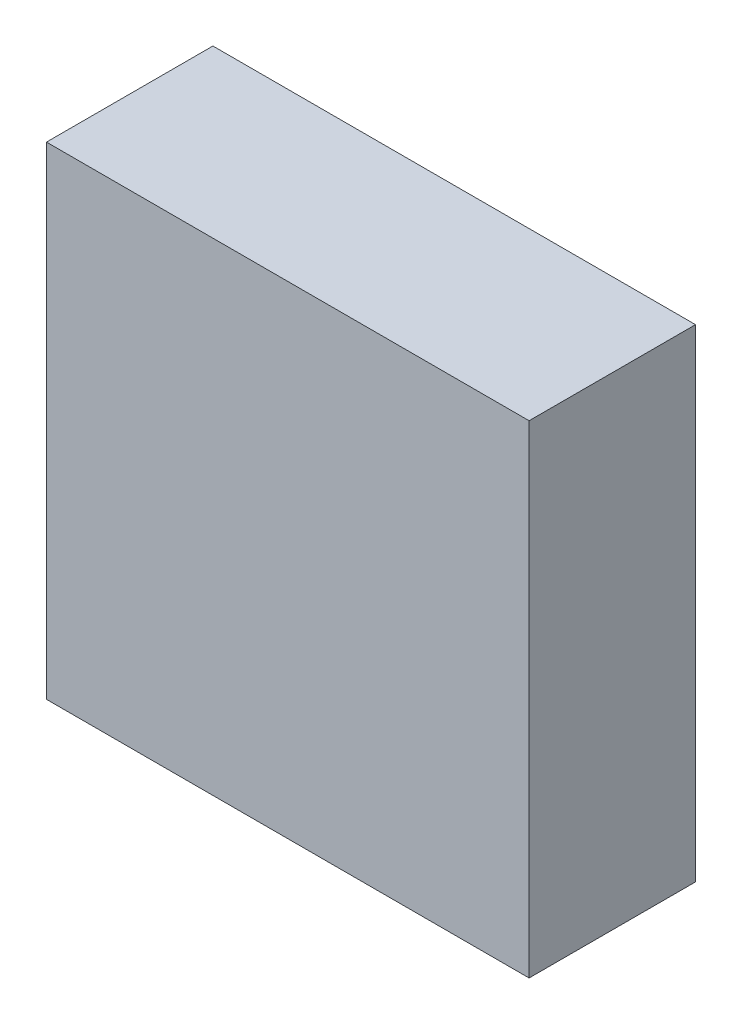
ISO-10303-21;
HEADER;
FILE_DESCRIPTION(('STEP AP214'),'2;1');
FILE_NAME('part.step','',(''),(''),'','','');
FILE_SCHEMA(('AUTOMOTIVE_DESIGN { 1 0 10303 214 1 1 1 1 }'));
ENDSEC;
DATA;
#1=APPLICATION_CONTEXT('core data for automotive mechanical design processes');
#2=APPLICATION_PROTOCOL_DEFINITION('international standard','automotive_design',2000,#1);
#3=PRODUCT_CONTEXT('',#1,'mechanical');
#4=PRODUCT('Part','Part','',(#3));
#5=PRODUCT_RELATED_PRODUCT_CATEGORY('part','',(#4));
#6=PRODUCT_DEFINITION_FORMATION('','',#4);
#7=PRODUCT_DEFINITION_CONTEXT('part definition',#1,'design');
#8=PRODUCT_DEFINITION('design','',#6,#7);
#9=PRODUCT_DEFINITION_SHAPE('','',#8);
#10=(LENGTH_UNIT() NAMED_UNIT(*) SI_UNIT(.MILLI.,.METRE.));
#11=(NAMED_UNIT(*) PLANE_ANGLE_UNIT() SI_UNIT($,.RADIAN.));
#12=(NAMED_UNIT(*) SI_UNIT($,.STERADIAN.) SOLID_ANGLE_UNIT());
#13=UNCERTAINTY_MEASURE_WITH_UNIT(LENGTH_MEASURE(1.E-05),#10,'distance_accuracy_value','');
#14=(GEOMETRIC_REPRESENTATION_CONTEXT(3) GLOBAL_UNCERTAINTY_ASSIGNED_CONTEXT((#13)) GLOBAL_UNIT_ASSIGNED_CONTEXT((#10,
#11,#12)) REPRESENTATION_CONTEXT('',''));
#15=CARTESIAN_POINT('',(0.,0.,0.));
#16=DIRECTION('',(0.,0.,1.));
#17=DIRECTION('',(1.,0.,0.));
#18=AXIS2_PLACEMENT_3D('',#15,#16,#17);
#19=CARTESIAN_POINT('',(-14.5,14.5,10.));
#20=DIRECTION('',(1.,0.,0.));
#21=DIRECTION('',(0.,1.,0.));
#22=AXIS2_PLACEMENT_3D('',#19,#20,#21);
#23=PLANE('',#22);
#24=DIRECTION('',(0.,-1.,0.));
#25=VECTOR('',#24,1.);
#26=CARTESIAN_POINT('',(-14.5,14.5,0.));
#27=LINE('',#26,#25);
#28=CARTESIAN_POINT('',(-14.5,14.5,0.));
#29=VERTEX_POINT('',#28);
#30=CARTESIAN_POINT('',(-14.5,-14.5,0.));
#31=VERTEX_POINT('',#30);
#32=EDGE_CURVE('E76',#29,#31,#27,.T.);
#33=ORIENTED_EDGE('',*,*,#32,.T.);
#34=DIRECTION('',(0.,0.,-1.));
#35=VECTOR('',#34,1.);
#36=CARTESIAN_POINT('',(-14.5,-14.5,10.));
#37=LINE('',#36,#35);
#38=CARTESIAN_POINT('',(-14.5,-14.5,10.));
#39=VERTEX_POINT('',#38);
#40=EDGE_CURVE('E11',#39,#31,#37,.T.);
#41=ORIENTED_EDGE('',*,*,#40,.F.);
#42=DIRECTION('',(0.,-1.,0.));
#43=VECTOR('',#42,1.);
#44=CARTESIAN_POINT('',(-14.5,14.5,10.));
#45=LINE('',#44,#43);
#46=CARTESIAN_POINT('',(-14.5,14.5,10.));
#47=VERTEX_POINT('',#46);
#48=EDGE_CURVE('E94',#47,#39,#45,.T.);
#49=ORIENTED_EDGE('',*,*,#48,.F.);
#50=DIRECTION('',(0.,0.,-1.));
#51=VECTOR('',#50,1.);
#52=CARTESIAN_POINT('',(-14.5,14.5,10.));
#53=LINE('',#52,#51);
#54=EDGE_CURVE('E88',#47,#29,#53,.T.);
#55=ORIENTED_EDGE('',*,*,#54,.T.);
#56=EDGE_LOOP('',(#33,#41,#49,#55));
#57=FACE_BOUND('',#56,.T.);
#58=ADVANCED_FACE('F32',(#57),#23,.F.);
#59=CARTESIAN_POINT('',(-14.5,-14.5,10.));
#60=DIRECTION('',(0.,1.,0.));
#61=DIRECTION('',(-1.,0.,0.));
#62=AXIS2_PLACEMENT_3D('',#59,#60,#61);
#63=PLANE('',#62);
#64=DIRECTION('',(1.,0.,0.));
#65=VECTOR('',#64,1.);
#66=CARTESIAN_POINT('',(-14.5,-14.5,0.));
#67=LINE('',#66,#65);
#68=CARTESIAN_POINT('',(14.5,-14.5,0.));
#69=VERTEX_POINT('',#68);
#70=EDGE_CURVE('E72',#31,#69,#67,.T.);
#71=ORIENTED_EDGE('',*,*,#70,.T.);
#72=DIRECTION('',(0.,0.,-1.));
#73=VECTOR('',#72,1.);
#74=CARTESIAN_POINT('',(14.5,-14.5,10.));
#75=LINE('',#74,#73);
#76=CARTESIAN_POINT('',(14.5,-14.5,10.));
#77=VERTEX_POINT('',#76);
#78=EDGE_CURVE('E39',#77,#69,#75,.T.);
#79=ORIENTED_EDGE('',*,*,#78,.F.);
#80=DIRECTION('',(1.,0.,0.));
#81=VECTOR('',#80,1.);
#82=CARTESIAN_POINT('',(-14.5,-14.5,10.));
#83=LINE('',#82,#81);
#84=EDGE_CURVE('E84',#39,#77,#83,.T.);
#85=ORIENTED_EDGE('',*,*,#84,.F.);
#86=ORIENTED_EDGE('',*,*,#40,.T.);
#87=EDGE_LOOP('',(#71,#79,#85,#86));
#88=FACE_BOUND('',#87,.T.);
#89=ADVANCED_FACE('F83',(#88),#63,.F.);
#90=CARTESIAN_POINT('',(14.5,14.5,10.));
#91=DIRECTION('',(-1.,0.,0.));
#92=DIRECTION('',(0.,-1.,0.));
#93=AXIS2_PLACEMENT_3D('',#90,#91,#92);
#94=PLANE('',#93);
#95=DIRECTION('',(0.,1.,0.));
#96=VECTOR('',#95,1.);
#97=CARTESIAN_POINT('',(14.5,14.5,0.));
#98=LINE('',#97,#96);
#99=CARTESIAN_POINT('',(14.5,14.5,0.));
#100=VERTEX_POINT('',#99);
#101=EDGE_CURVE('E77',#69,#100,#98,.T.);
#102=ORIENTED_EDGE('',*,*,#101,.T.);
#103=DIRECTION('',(0.,0.,-1.));
#104=VECTOR('',#103,1.);
#105=CARTESIAN_POINT('',(14.5,14.5,10.));
#106=LINE('',#105,#104);
#107=CARTESIAN_POINT('',(14.5,14.5,10.));
#108=VERTEX_POINT('',#107);
#109=EDGE_CURVE('E100',#108,#100,#106,.T.);
#110=ORIENTED_EDGE('',*,*,#109,.F.);
#111=DIRECTION('',(0.,1.,0.));
#112=VECTOR('',#111,1.);
#113=CARTESIAN_POINT('',(14.5,14.5,10.));
#114=LINE('',#113,#112);
#115=EDGE_CURVE('E51',#77,#108,#114,.T.);
#116=ORIENTED_EDGE('',*,*,#115,.F.);
#117=ORIENTED_EDGE('',*,*,#78,.T.);
#118=EDGE_LOOP('',(#102,#110,#116,#117));
#119=FACE_BOUND('',#118,.T.);
#120=ADVANCED_FACE('F103',(#119),#94,.F.);
#121=CARTESIAN_POINT('',(-14.5,14.5,10.));
#122=DIRECTION('',(0.,-1.,0.));
#123=DIRECTION('',(0.,0.,-1.));
#124=AXIS2_PLACEMENT_3D('',#121,#122,#123);
#125=PLANE('',#124);
#126=DIRECTION('',(-1.,0.,0.));
#127=VECTOR('',#126,1.);
#128=CARTESIAN_POINT('',(-14.5,14.5,0.));
#129=LINE('',#128,#127);
#130=EDGE_CURVE('E92',#100,#29,#129,.T.);
#131=ORIENTED_EDGE('',*,*,#130,.T.);
#132=ORIENTED_EDGE('',*,*,#54,.F.);
#133=DIRECTION('',(-1.,0.,0.));
#134=VECTOR('',#133,1.);
#135=CARTESIAN_POINT('',(-14.5,14.5,10.));
#136=LINE('',#135,#134);
#137=EDGE_CURVE('E46',#108,#47,#136,.T.);
#138=ORIENTED_EDGE('',*,*,#137,.F.);
#139=ORIENTED_EDGE('',*,*,#109,.T.);
#140=EDGE_LOOP('',(#131,#132,#138,#139));
#141=FACE_BOUND('',#140,.T.);
#142=ADVANCED_FACE('F105',(#141),#125,.F.);
#143=CARTESIAN_POINT('',(-14.5,-14.5,10.));
#144=DIRECTION('',(0.,0.,1.));
#145=DIRECTION('',(1.,0.,0.));
#146=AXIS2_PLACEMENT_3D('',#143,#144,#145);
#147=PLANE('',#146);
#148=ORIENTED_EDGE('',*,*,#48,.T.);
#149=ORIENTED_EDGE('',*,*,#84,.T.);
#150=ORIENTED_EDGE('',*,*,#115,.T.);
#151=ORIENTED_EDGE('',*,*,#137,.T.);
#152=EDGE_LOOP('',(#148,#149,#150,#151));
#153=FACE_BOUND('',#152,.T.);
#154=ADVANCED_FACE('F106',(#153),#147,.T.);
#155=CARTESIAN_POINT('',(-14.5,-14.5,0.));
#156=DIRECTION('',(0.,0.,1.));
#157=DIRECTION('',(1.,0.,0.));
#158=AXIS2_PLACEMENT_3D('',#155,#156,#157);
#159=PLANE('',#158);
#160=ORIENTED_EDGE('',*,*,#32,.F.);
#161=ORIENTED_EDGE('',*,*,#130,.F.);
#162=ORIENTED_EDGE('',*,*,#101,.F.);
#163=ORIENTED_EDGE('',*,*,#70,.F.);
#164=EDGE_LOOP('',(#160,#161,#162,#163));
#165=FACE_BOUND('',#164,.T.);
#166=ADVANCED_FACE('F73',(#165),#159,.F.);
#167=CLOSED_SHELL('',(#58,#89,#120,#142,#154,#166));
#168=MANIFOLD_SOLID_BREP('B2',#167);
#169=ADVANCED_BREP_SHAPE_REPRESENTATION('',(#18,#168),#14);
#170=SHAPE_DEFINITION_REPRESENTATION(#9,#169);
ENDSEC;
END-ISO-10303-21;
